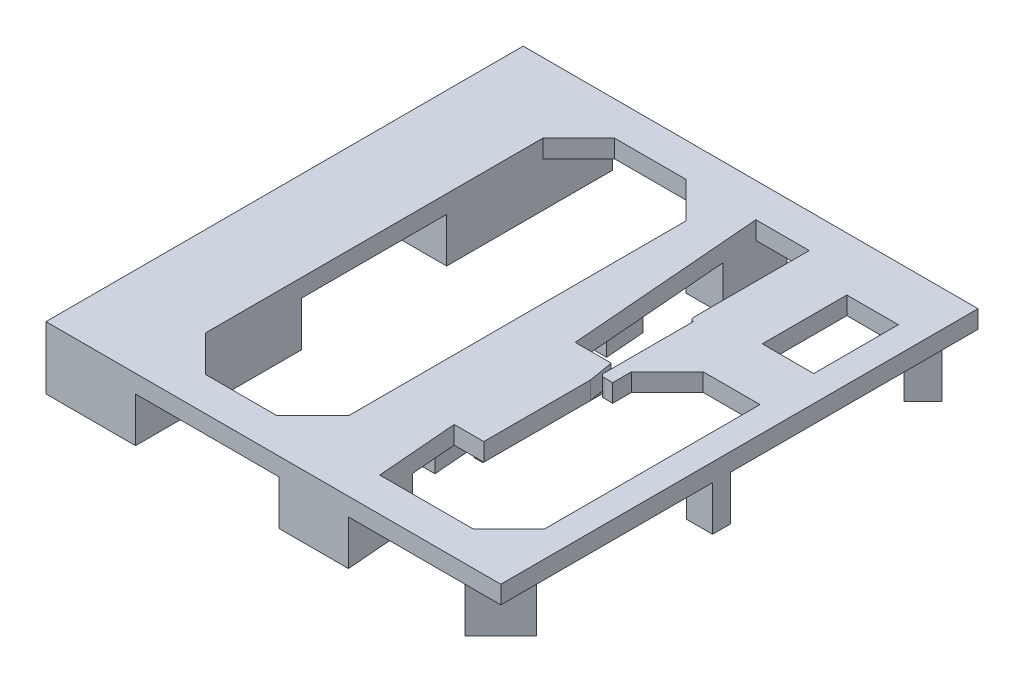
from build123d import *

# Parameters (mm, degrees)
SKETCH11_W          = 50.8
SKETCH11_H          = 53.3
SKETCH11_W_2        = 5.75
SKETCH11_H_2        = 9.45
BOSS_EXTRUDE1_DEPTH = 2
SKETCH12_W          = 2.9
SKETCH12_H          = 2
SKETCH12_W_2        = 10
SKETCH12_H_2        = 18.55
BOSS_EXTRUDE2_DEPTH = 5
SKETCH13_W          = 1
SKETCH13_H          = 14
BOSS_EXTRUDE3_DEPTH = 0.4


with BuildPart() as part:
    # Sketch11 → Boss-Extrude1 (new body)
    with BuildSketch(Plane(origin=(0, 0, 0), x_dir=(1, 0, 0), z_dir=(0, 1, 0))):
        with Locations((31.5, 0)):
            Rectangle(SKETCH11_W, SKETCH11_H)
        Polygon((32.1, -18.85), (28.1, -22.85), (20.1, -22.85), (16.1, -18.85), (16.1, 18.85), (20.1, 22.85), (28.1, 22.85), (32.1, 18.85), align=None, mode=Mode.SUBTRACT)
        with BuildLine():
            Line((54, -18.85), (50, -22.85))
            Line((50, -22.85), (39.5765076, -22.85))
            Line((39.5765076, -22.85), (38.846785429, -13.8))
            Line((38.846785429, -13.8), (42.15, -13.8))
            Line((42.15, -13.8), (42.15, -1.873333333))
            Line((42.15, -1.873333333), (41.68258427, 0.9))
            Line((41.68258427, 0.9), (37.661490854, 0.9))
            Line((37.661490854, 0.9), (35.89161222, 22.85))
            Line((35.89161222, 22.85), (41.85, 22.85))
            Line((41.85, 22.85), (41.85, 9.9))
            ThreePointArc((41.85, 9.9), (41.967157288, 9.617157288), (42.25, 9.5))
            Line((42.25, 9.5), (42.25, 8.3))
            Line((42.25, 8.3), (42.25, -0.5))
            ThreePointArc((42.25, -0.5), (42.367157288, -0.782842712), (42.65, -0.9))
            Line((42.65, -0.9), (43.65, -0.9))
            Line((43.65, -0.9), (43.65, 1.2))
            Line((43.65, 1.2), (47.65, 5.2))
            Line((47.65, 5.2), (54, 5.2))
            Line((54, 5.2), (54, -18.85))
        make_face(mode=Mode.SUBTRACT)
        with Locations((51.125, 15.925)):
            Rectangle(SKETCH11_W_2, SKETCH11_H_2, mode=Mode.SUBTRACT)
    extrude(amount=BOSS_EXTRUDE1_DEPTH)

    # Sketch12 → Boss-Extrude2 (add)
    with BuildSketch(Plane(origin=(0, 0, 0), x_dir=(1, 0, 0), z_dir=(0, 1, 0))):
        with Locations((55.45, -2)):
            Rectangle(SKETCH12_W, SKETCH12_H)
        Polygon((33.867325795, 8.2), (33.508512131, 12.65), (32.1, 12.65), (32.1, 8.2), align=None)
        with Locations((11.1, 17.375)):
            Rectangle(SKETCH12_W_2, SKETCH12_H_2)
        Polygon((32.1, -8.2), (35.189695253, -8.2), (35.548508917, -12.65), (32.1, -12.65), align=None)
        with Locations((11.1, -17.375)):
            Rectangle(SKETCH12_W_2, SKETCH12_H_2)
        Polygon((56.9, 22.65), (52.9, 26.65), (50.778679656, 24.528679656), (54.778679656, 20.528679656), align=None)
        Polygon((56.9, -22.65), (52.9, -26.65), (50.778679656, -24.528679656), (54.778679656, -20.528679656), align=None)
        Polygon((32.1, 26.65), (35.585209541, 26.65), (36.214141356, 18.85), (32.1, 18.85), align=None)
        Polygon((39.253978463, -18.85), (32.1, -18.85), (32.1, -26.65), (39.882910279, -26.65), align=None)
    extrude(amount=-BOSS_EXTRUDE2_DEPTH)

    # Sketch13 → Boss-Extrude3 (add)
    with BuildSketch(Plane(origin=(0, 0, 0), x_dir=(1, 0, 0), z_dir=(0, 1, 0))):
        with Locations((42.75, 6.5)):
            Rectangle(SKETCH13_W, SKETCH13_H)
        with Locations((41.25, -6.5)):
            Rectangle(SKETCH13_W, SKETCH13_H)
    extrude(amount=-BOSS_EXTRUDE3_DEPTH)


solid = part.part
